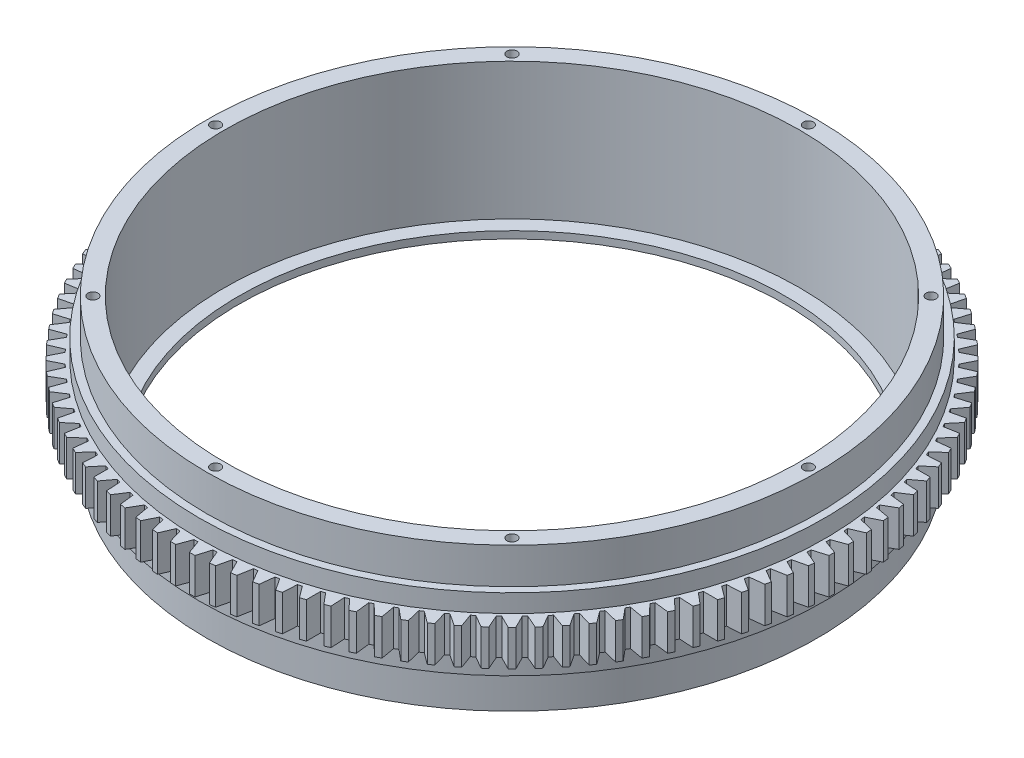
from build123d import *

# Parameters (mm, degrees)
SKETCH1_R         = 53.9242
EXTRUDE1_DEPTH    = 25.4
SKETCH2_R         = 48.26
EXTRUDE2_DEPTH    = 81.379093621
EXTRUDE3_START    = 1.27
SKETCH3_R         = 50.8
EXTRUDE3_DEPTH    = 80.109093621
EXTRUDE6_START    = 6.35
SKETCH6_R         = 55.245
SKETCH6_R_2       = 53.9242
EXTRUDE6_DEPTH    = 12.7
EXTRUDE4_START    = 9.525
SKETCH4_R         = 58.2041
SKETCH4_R_2       = 55.245
EXTRUDE4_DEPTH    = 6.35
EXTRUDE5_DEPTH    = 84.829888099
CIRPATTERN1_COUNT = 108
CIRPATTERN4_COUNT = 8


with BuildPart() as part:
    # Sketch1 → Extrude1 (new body)
    with BuildSketch(Plane(origin=(0, 0, 0), x_dir=(1, 0, 0), z_dir=(0, 1, 0))):
        with Locations(Location((0, 0, 0), (0, 0, 270))):
            Circle(SKETCH1_R)
    extrude(amount=EXTRUDE1_DEPTH)

    # Sketch2 → Extrude2 (cut, through all)
    with BuildSketch(Plane(origin=(0, 0, 0), x_dir=(-1, 0, 0), z_dir=(0, 1, 0))):
        with Locations(Location((0, 0, 0), (0, 0, 90))):
            Circle(SKETCH2_R)
    extrude(amount=EXTRUDE2_DEPTH, mode=Mode.SUBTRACT)

    # Sketch3 → Extrude3 (cut, through all)
    with BuildSketch(Plane(origin=(0, 0, 0), x_dir=(-1, 0, 0), z_dir=(0, 1, 0)).offset(EXTRUDE3_START)):
        with Locations(Location((0, 0, 0), (0, 0, 270))):
            Circle(SKETCH3_R)
    extrude(amount=EXTRUDE3_DEPTH, mode=Mode.SUBTRACT)

    # Sketch6 → Extrude6 (add)
    with BuildSketch(Plane(origin=(0, 0, 0), x_dir=(-1, 0, 0), z_dir=(0, 1, 0)).offset(EXTRUDE6_START)):
        with Locations(Location((0, 0, 0), (0, 0, 90))):
            Circle(SKETCH6_R)
        with Locations(Location((0, 0, 0), (0, 0, 90))):
            Circle(SKETCH6_R_2, mode=Mode.SUBTRACT)
    extrude(amount=EXTRUDE6_DEPTH)

    # Sketch4 → Extrude4 (add)
    with BuildSketch(Plane(origin=(0, 0, 0), x_dir=(-1, 0, 0), z_dir=(0, 1, 0)).offset(EXTRUDE4_START)):
        with Locations(Location((0, 0, 0), (0, 0, 90))):
            Circle(SKETCH4_R)
        with Locations(Location((0, 0, 0), (0, 0, 90))):
            Circle(SKETCH4_R_2, mode=Mode.SUBTRACT)
    extrude(amount=EXTRUDE4_DEPTH)

    # Sketch5 → Extrude5 (cut, symmetric)
    with BuildSketch(Plane.XZ.offset(-9.525)):
        Polygon((94.022019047, -313.191374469), (1.209665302, -58.191528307), (0.347074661, -55.82158), (-0.347074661, -55.82158), (-1.209665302, -58.191528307), (-94.022019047, -313.191374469), (-94.022019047, -855.921711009), (94.022019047, -855.921711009), align=None)
    extrude5 = extrude(amount=EXTRUDE5_DEPTH, both=True, mode=Mode.SUBTRACT)

    # CirPattern1: Extrude5 ×108 about axis
    cirpattern1_axis = Axis((0, 15.875, 0), (0, -1, 0))
    for i in range(1, CIRPATTERN1_COUNT):
        add(extrude5.rotate(cirpattern1_axis, i * 360 / CIRPATTERN1_COUNT), mode=Mode.SUBTRACT)

    # Sketch11 → Tap Drill for _2-56 Tap2 (revolve, cut)
    with BuildSketch(Plane(origin=(-52.3494, 25.4, 0), x_dir=(0, 0, 1), z_dir=(1, 0, 0))):
        Polygon((0, 0), (0, 9.67816509), (0.889, 9.144), (0.889, 0), align=None)
    tap_drill_for_2_56_tap2 = revolve(axis=Axis((-52.3494, 31.75, 0), (0, -1, 0)), mode=Mode.SUBTRACT)

    # CirPattern4: Tap Drill for _2-56 Tap2 ×8 about axis
    cirpattern4_axis = Axis((0, 0, 0), (0, 1, 0))
    for i in range(1, CIRPATTERN4_COUNT):
        add(tap_drill_for_2_56_tap2.rotate(cirpattern4_axis, i * 360 / CIRPATTERN4_COUNT), mode=Mode.SUBTRACT)


solid = part.part
